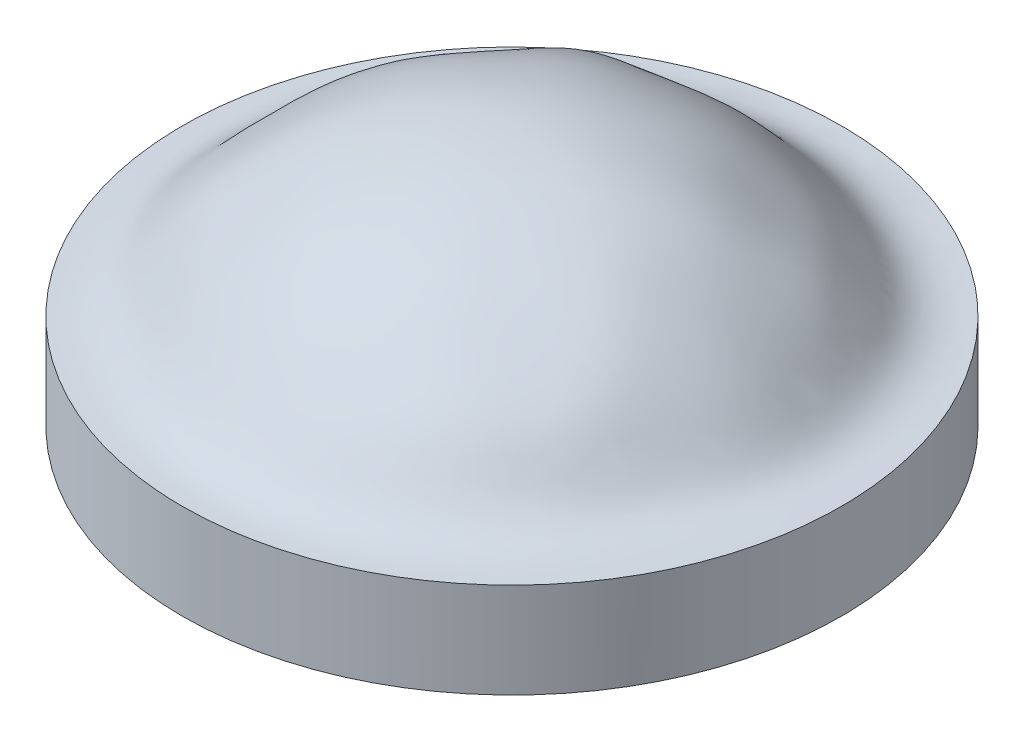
ISO-10303-21;
HEADER;
FILE_DESCRIPTION(('STEP AP214'),'2;1');
FILE_NAME('part.step','',(''),(''),'','','');
FILE_SCHEMA(('AUTOMOTIVE_DESIGN { 1 0 10303 214 1 1 1 1 }'));
ENDSEC;
DATA;
#1=APPLICATION_CONTEXT('core data for automotive mechanical design processes');
#2=APPLICATION_PROTOCOL_DEFINITION('international standard','automotive_design',2000,#1);
#3=PRODUCT_CONTEXT('',#1,'mechanical');
#4=PRODUCT('Part','Part','',(#3));
#5=PRODUCT_RELATED_PRODUCT_CATEGORY('part','',(#4));
#6=PRODUCT_DEFINITION_FORMATION('','',#4);
#7=PRODUCT_DEFINITION_CONTEXT('part definition',#1,'design');
#8=PRODUCT_DEFINITION('design','',#6,#7);
#9=PRODUCT_DEFINITION_SHAPE('','',#8);
#10=(LENGTH_UNIT() NAMED_UNIT(*) SI_UNIT(.MILLI.,.METRE.));
#11=(NAMED_UNIT(*) PLANE_ANGLE_UNIT() SI_UNIT($,.RADIAN.));
#12=(NAMED_UNIT(*) SI_UNIT($,.STERADIAN.) SOLID_ANGLE_UNIT());
#13=UNCERTAINTY_MEASURE_WITH_UNIT(LENGTH_MEASURE(1.E-05),#10,'distance_accuracy_value','');
#14=(GEOMETRIC_REPRESENTATION_CONTEXT(3) GLOBAL_UNCERTAINTY_ASSIGNED_CONTEXT((#13)) GLOBAL_UNIT_ASSIGNED_CONTEXT((#10,
#11,#12)) REPRESENTATION_CONTEXT('',''));
#15=CARTESIAN_POINT('',(0.,0.,0.));
#16=DIRECTION('',(0.,0.,1.));
#17=DIRECTION('',(1.,0.,0.));
#18=AXIS2_PLACEMENT_3D('',#15,#16,#17);
#19=CARTESIAN_POINT('',(-35.5226864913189,12.2853963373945,-34.6000857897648));
#20=CARTESIAN_POINT('',(-34.2932035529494,12.5983433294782,-34.659800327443));
#21=CARTESIAN_POINT('',(-31.9349826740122,12.9464040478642,-35.0365431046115));
#22=CARTESIAN_POINT('',(-27.8924752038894,12.6746638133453,-34.7169109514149));
#23=CARTESIAN_POINT('',(-23.319355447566,10.8754227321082,-34.9154026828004));
#24=CARTESIAN_POINT('',(-17.5047239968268,10.1119375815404,-34.9769828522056));
#25=CARTESIAN_POINT('',(-11.6731992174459,9.977244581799,-35.0138360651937));
#26=CARTESIAN_POINT('',(-5.83863273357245,9.99716292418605,-35.0327033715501));
#27=CARTESIAN_POINT('',(0.000238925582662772,9.99831315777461,-35.0328217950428));
#28=CARTESIAN_POINT('',(5.83938248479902,9.99732332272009,-35.0326949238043));
#29=CARTESIAN_POINT('',(11.6811567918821,9.96419965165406,-35.0146621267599));
#30=CARTESIAN_POINT('',(17.4947019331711,9.89352429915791,-34.9889074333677));
#31=CARTESIAN_POINT('',(23.1754415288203,9.65126325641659,-34.9766955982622));
#32=CARTESIAN_POINT('',(27.3967452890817,8.90491840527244,-34.8903182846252));
#33=CARTESIAN_POINT('',(31.1950617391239,11.3772508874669,-35.5372329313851));
#34=CARTESIAN_POINT('',(33.5313468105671,11.3824886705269,-35.2377620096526));
#35=CARTESIAN_POINT('',(34.7724966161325,11.7132210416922,-35.2255062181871));
#36=CARTESIAN_POINT('',(-35.5342685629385,11.7619439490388,-33.3856293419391));
#37=CARTESIAN_POINT('',(-34.3279663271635,11.9966616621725,-33.5559225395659));
#38=CARTESIAN_POINT('',(-31.8204907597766,12.7356878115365,-33.6664962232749));
#39=CARTESIAN_POINT('',(-27.9812804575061,11.8635729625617,-33.7865666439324));
#40=CARTESIAN_POINT('',(-23.3285003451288,10.4549887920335,-33.8519919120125));
#41=CARTESIAN_POINT('',(-17.5136244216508,10.0362061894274,-33.891368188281));
#42=CARTESIAN_POINT('',(-11.6832312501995,10.0097950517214,-33.8919057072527));
#43=CARTESIAN_POINT('',(-5.84307774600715,10.0267107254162,-33.881555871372));
#44=CARTESIAN_POINT('',(-0.000605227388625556,10.0042513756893,-33.8690313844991));
#45=CARTESIAN_POINT('',(5.8351408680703,10.0290535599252,-33.8813889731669));
#46=CARTESIAN_POINT('',(11.6754146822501,10.0396603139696,-33.8896912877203));
#47=CARTESIAN_POINT('',(17.5009995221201,9.99392765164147,-33.8900787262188));
#48=CARTESIAN_POINT('',(23.2428148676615,9.80705408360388,-33.88264965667));
#49=CARTESIAN_POINT('',(27.6286459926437,9.5341812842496,-33.9295528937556));
#50=CARTESIAN_POINT('',(31.1156175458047,10.7484520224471,-34.1071483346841));
#51=CARTESIAN_POINT('',(33.6947980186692,11.4989093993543,-34.0745419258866));
#52=CARTESIAN_POINT('',(34.8364221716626,11.799057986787,-33.9972341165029));
#53=CARTESIAN_POINT('',(-35.8137679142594,11.6555911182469,-31.0983236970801));
#54=CARTESIAN_POINT('',(-34.3784335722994,10.8838491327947,-31.0310824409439));
#55=CARTESIAN_POINT('',(-31.7057372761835,10.7673795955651,-31.3125719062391));
#56=CARTESIAN_POINT('',(-28.0184362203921,10.4590833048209,-31.5353528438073));
#57=CARTESIAN_POINT('',(-23.3658940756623,10.1059608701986,-31.6255067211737));
#58=CARTESIAN_POINT('',(-17.5384744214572,10.0061683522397,-31.5734219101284));
#59=CARTESIAN_POINT('',(-11.6774348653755,9.95536773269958,-31.4870284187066));
#60=CARTESIAN_POINT('',(-5.81826908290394,9.89454648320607,-31.4524522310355));
#61=CARTESIAN_POINT('',(0.0210012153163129,9.85503598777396,-31.4536355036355));
#62=CARTESIAN_POINT('',(5.85803380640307,9.86311248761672,-31.4550675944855));
#63=CARTESIAN_POINT('',(11.7021527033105,9.98421644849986,-31.4900813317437));
#64=CARTESIAN_POINT('',(17.5452881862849,10.1191390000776,-31.5672654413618));
#65=CARTESIAN_POINT('',(23.3501728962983,10.0342760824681,-31.6161820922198));
#66=CARTESIAN_POINT('',(27.9005554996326,9.82608809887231,-31.5901984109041));
#67=CARTESIAN_POINT('',(31.3747718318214,10.4261613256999,-31.5661428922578));
#68=CARTESIAN_POINT('',(33.8244558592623,11.6890221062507,-31.5482932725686));
#69=CARTESIAN_POINT('',(35.2032759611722,12.0858424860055,-31.6498026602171));
#70=CARTESIAN_POINT('',(-35.0606099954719,8.11899997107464,-27.401921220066));
#71=CARTESIAN_POINT('',(-34.0444611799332,9.09434156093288,-27.6303760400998));
#72=CARTESIAN_POINT('',(-31.6288758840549,9.76572401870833,-27.9008698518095));
#73=CARTESIAN_POINT('',(-28.1021713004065,10.1356231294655,-28.1070807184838));
#74=CARTESIAN_POINT('',(-23.410937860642,10.0873110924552,-28.0780922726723));
#75=CARTESIAN_POINT('',(-17.4851840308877,9.75200352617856,-27.8779341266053));
#76=CARTESIAN_POINT('',(-11.614192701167,9.73358853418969,-27.8845472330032));
#77=CARTESIAN_POINT('',(-5.88666918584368,10.3802195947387,-28.263690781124));
#78=CARTESIAN_POINT('',(-0.232297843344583,11.342310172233,-28.7255505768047));
#79=CARTESIAN_POINT('',(5.68743986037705,10.2134979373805,-28.2543082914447));
#80=CARTESIAN_POINT('',(11.6072046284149,9.61959718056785,-27.8879462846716));
#81=CARTESIAN_POINT('',(17.5226116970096,9.87304944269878,-27.8882265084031));
#82=CARTESIAN_POINT('',(23.4301966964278,10.2320425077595,-28.0677988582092));
#83=CARTESIAN_POINT('',(28.097744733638,10.0949258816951,-28.093905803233));
#84=CARTESIAN_POINT('',(31.5634284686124,10.1738358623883,-27.9793474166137));
#85=CARTESIAN_POINT('',(33.8860883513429,10.8897388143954,-27.8700690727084));
#86=CARTESIAN_POINT('',(34.8609380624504,11.0896793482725,-27.73725548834));
#87=CARTESIAN_POINT('',(-35.0138783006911,9.30420339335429,-23.1731945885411));
#88=CARTESIAN_POINT('',(-33.9080592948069,9.66287983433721,-23.2467982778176));
#89=CARTESIAN_POINT('',(-31.6297519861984,10.0894472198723,-23.3614629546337));
#90=CARTESIAN_POINT('',(-28.0651132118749,10.2662143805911,-23.4306897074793));
#91=CARTESIAN_POINT('',(-23.2018472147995,9.61379405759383,-23.2170902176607));
#92=CARTESIAN_POINT('',(-17.3785862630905,9.6137418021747,-23.254190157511));
#93=CARTESIAN_POINT('',(-11.930590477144,12.0410253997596,-24.3168441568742));
#94=CARTESIAN_POINT('',(-6.36626542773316,15.5156268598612,-26.1071595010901));
#95=CARTESIAN_POINT('',(0.280387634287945,14.6811575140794,-26.1060123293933));
#96=CARTESIAN_POINT('',(6.08347490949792,14.7482921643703,-26.1000453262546));
#97=CARTESIAN_POINT('',(11.6763825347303,11.2284796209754,-24.294250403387));
#98=CARTESIAN_POINT('',(17.3286523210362,9.37002822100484,-23.2511724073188));
#99=CARTESIAN_POINT('',(23.2296104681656,9.70171755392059,-23.2273204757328));
#100=CARTESIAN_POINT('',(28.0707247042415,10.1434719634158,-23.4138233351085));
#101=CARTESIAN_POINT('',(31.6197464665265,10.0547657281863,-23.3505917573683));
#102=CARTESIAN_POINT('',(33.8784204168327,10.1982026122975,-23.3043163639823));
#103=CARTESIAN_POINT('',(34.9705750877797,10.4099038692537,-23.2897602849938));
#104=CARTESIAN_POINT('',(-34.9788145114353,9.75020462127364,-17.4895894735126));
#105=CARTESIAN_POINT('',(-33.8991356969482,10.0194096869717,-17.5050494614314));
#106=CARTESIAN_POINT('',(-31.5709024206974,10.1807643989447,-17.5472791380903));
#107=CARTESIAN_POINT('',(-27.8570125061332,9.7609452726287,-17.5056707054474));
#108=CARTESIAN_POINT('',(-23.282894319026,9.43505533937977,-17.3415389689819));
#109=CARTESIAN_POINT('',(-18.6935057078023,13.5239150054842,-18.5866278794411));
#110=CARTESIAN_POINT('',(-13.569355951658,22.4750943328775,-21.4362901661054));
#111=CARTESIAN_POINT('',(-6.78799689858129,16.3716720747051,-19.8611886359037));
#112=CARTESIAN_POINT('',(-0.256994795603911,21.6815821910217,-21.6827200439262));
#113=CARTESIAN_POINT('',(7.17443085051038,18.1588600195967,-19.8770077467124));
#114=CARTESIAN_POINT('',(13.4590287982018,18.9213910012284,-21.485042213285));
#115=CARTESIAN_POINT('',(18.5610510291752,13.248010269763,-18.613015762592));
#116=CARTESIAN_POINT('',(23.2509617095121,9.46512781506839,-17.3445760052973));
#117=CARTESIAN_POINT('',(27.887210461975,9.85024562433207,-17.5190374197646));
#118=CARTESIAN_POINT('',(31.5663430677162,10.0371338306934,-17.5342209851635));
#119=CARTESIAN_POINT('',(33.8898078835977,10.0064957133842,-17.5035435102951));
#120=CARTESIAN_POINT('',(34.9917716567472,10.0601066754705,-17.5156909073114));
#121=CARTESIAN_POINT('',(-35.0061507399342,9.92089502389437,-11.6788663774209));
#122=CARTESIAN_POINT('',(-33.8993521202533,10.0947208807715,-11.6784245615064));
#123=CARTESIAN_POINT('',(-31.4688526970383,9.90189369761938,-11.6947671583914));
#124=CARTESIAN_POINT('',(-27.8835962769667,9.5482081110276,-11.6044054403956));
#125=CARTESIAN_POINT('',(-24.4877559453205,11.8469779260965,-11.7640386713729));
#126=CARTESIAN_POINT('',(-21.3537558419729,17.4834910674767,-13.5477556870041));
#127=CARTESIAN_POINT('',(-13.4618217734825,17.5554839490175,-13.3381726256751));
#128=CARTESIAN_POINT('',(-7.56652416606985,26.751137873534,-15.6791817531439));
#129=CARTESIAN_POINT('',(0.168292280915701,21.627342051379,-14.5098333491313));
#130=CARTESIAN_POINT('',(7.65877279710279,25.9664337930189,-15.7043847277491));
#131=CARTESIAN_POINT('',(13.2257357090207,16.4856550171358,-13.2498974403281));
#132=CARTESIAN_POINT('',(21.6085029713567,21.5866198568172,-13.7167360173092));
#133=CARTESIAN_POINT('',(24.2812780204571,11.4361137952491,-11.724180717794));
#134=CARTESIAN_POINT('',(27.8901718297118,9.69933738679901,-11.617895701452));
#135=CARTESIAN_POINT('',(31.4930626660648,10.0025381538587,-11.7009069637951));
#136=CARTESIAN_POINT('',(33.8874124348,10.0022747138,-11.6725845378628));
#137=CARTESIAN_POINT('',(35.0168170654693,9.98777915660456,-11.6822319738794));
#138=CARTESIAN_POINT('',(-35.0320889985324,9.9948920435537,-5.83924342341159));
#139=CARTESIAN_POINT('',(-33.8885658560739,10.0606760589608,-5.83690698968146));
#140=CARTESIAN_POINT('',(-31.4188139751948,9.6997492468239,-5.84864234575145));
#141=CARTESIAN_POINT('',(-28.4130072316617,10.796754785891,-5.73161164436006));
#142=CARTESIAN_POINT('',(-26.39513030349,16.0299460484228,-6.22249058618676));
#143=CARTESIAN_POINT('',(-19.8098025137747,19.1845169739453,-7.18080570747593));
#144=CARTESIAN_POINT('',(-15.5725798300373,25.7550422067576,-7.65055211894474));
#145=CARTESIAN_POINT('',(-7.29244627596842,23.670399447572,-7.48704507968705));
#146=CARTESIAN_POINT('',(0.052073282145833,28.9729347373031,-8.02893337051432));
#147=CARTESIAN_POINT('',(7.47014783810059,23.3344898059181,-7.48123145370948));
#148=CARTESIAN_POINT('',(15.7534413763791,26.4699460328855,-7.68314616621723));
#149=CARTESIAN_POINT('',(19.8315687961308,16.9854860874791,-6.92245759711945));
#150=CARTESIAN_POINT('',(26.0690647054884,14.8396408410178,-6.10396920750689));
#151=CARTESIAN_POINT('',(28.2213998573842,10.0432230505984,-5.70399669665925));
#152=CARTESIAN_POINT('',(31.4644387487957,9.94826907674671,-5.85962943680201));
#153=CARTESIAN_POINT('',(33.8795211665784,10.0150705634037,-5.8351792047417));
#154=CARTESIAN_POINT('',(35.0328596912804,9.99828034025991,-5.83934181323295));
#155=CARTESIAN_POINT('',(-35.0322970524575,9.99572760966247,-0.000102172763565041));
#156=CARTESIAN_POINT('',(-33.8702731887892,10.0102825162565,0.000287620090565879));
#157=CARTESIAN_POINT('',(-31.4170184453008,9.69915385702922,-0.0122313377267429));
#158=CARTESIAN_POINT('',(-29.0927556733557,12.7794260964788,0.147806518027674));
#159=CARTESIAN_POINT('',(-25.7598717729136,13.574576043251,-0.25813287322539));
#160=CARTESIAN_POINT('',(-21.858848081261,22.5527150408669,0.209813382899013));
#161=CARTESIAN_POINT('',(-14.328163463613,21.8698072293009,-0.192613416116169));
#162=CARTESIAN_POINT('',(-7.96341465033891,29.2017893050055,-0.00552030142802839));
#163=CARTESIAN_POINT('',(0.167953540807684,25.5921960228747,-0.199117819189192));
#164=CARTESIAN_POINT('',(8.09172182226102,29.0028420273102,0.0342265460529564));
#165=CARTESIAN_POINT('',(14.5681530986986,21.8038875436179,-0.120119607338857));
#166=CARTESIAN_POINT('',(21.5522940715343,20.5770047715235,0.209098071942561));
#167=CARTESIAN_POINT('',(26.2361511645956,15.4843600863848,-0.173454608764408));
#168=CARTESIAN_POINT('',(28.62150659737,10.6818182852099,0.206635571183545));
#169=CARTESIAN_POINT('',(31.4634889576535,9.91974893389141,-0.0195729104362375));
#170=CARTESIAN_POINT('',(33.8686764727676,10.0017930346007,0.000627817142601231));
#171=CARTESIAN_POINT('',(35.0329594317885,9.99928094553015,-0.000245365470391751));
#172=CARTESIAN_POINT('',(-35.0321032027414,9.99473112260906,5.83877071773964));
#173=CARTESIAN_POINT('',(-33.888807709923,10.0583590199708,5.84133341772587));
#174=CARTESIAN_POINT('',(-31.4151838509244,9.73021665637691,5.82701409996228));
#175=CARTESIAN_POINT('',(-28.4180031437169,10.9789221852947,5.85905275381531));
#176=CARTESIAN_POINT('',(-26.4424107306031,17.8411186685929,6.29656813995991));
#177=CARTESIAN_POINT('',(-19.8526380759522,16.7884185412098,6.73987992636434));
#178=CARTESIAN_POINT('',(-15.5172977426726,27.1932738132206,7.62472798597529));
#179=CARTESIAN_POINT('',(-7.28879917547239,23.5023876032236,7.29133076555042));
#180=CARTESIAN_POINT('',(0.106055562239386,29.5523559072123,8.03334939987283));
#181=CARTESIAN_POINT('',(7.44513460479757,23.0991036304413,7.18931607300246));
#182=CARTESIAN_POINT('',(15.7030060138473,26.0007668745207,7.66274881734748));
#183=CARTESIAN_POINT('',(20.1115614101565,18.4172572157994,6.76315199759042));
#184=CARTESIAN_POINT('',(25.9564450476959,14.0307287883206,6.45828201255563));
#185=CARTESIAN_POINT('',(28.1989554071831,9.9250038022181,5.87715678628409));
#186=CARTESIAN_POINT('',(31.4638509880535,9.94839943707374,5.82136959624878));
#187=CARTESIAN_POINT('',(33.8795937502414,10.0152407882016,5.84270588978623));
#188=CARTESIAN_POINT('',(35.0328672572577,9.99830302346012,5.838651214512));
#189=CARTESIAN_POINT('',(-35.0049139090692,9.93380383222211,11.6754407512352));
#190=CARTESIAN_POINT('',(-33.9025238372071,10.0658758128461,11.6806429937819));
#191=CARTESIAN_POINT('',(-31.4663106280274,9.86596862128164,11.6805213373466));
#192=CARTESIAN_POINT('',(-27.8738357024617,9.6034847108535,11.6183623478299));
#193=CARTESIAN_POINT('',(-24.4858506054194,12.9060380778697,11.927625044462));
#194=CARTESIAN_POINT('',(-21.0911589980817,21.476006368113,13.7768068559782));
#195=CARTESIAN_POINT('',(-13.4516741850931,17.8316291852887,13.4636150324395));
#196=CARTESIAN_POINT('',(-7.54135107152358,26.337662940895,15.5574540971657));
#197=CARTESIAN_POINT('',(-0.0760947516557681,21.2068911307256,14.2874775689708));
#198=CARTESIAN_POINT('',(7.95751683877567,27.8689450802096,15.6393033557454));
#199=CARTESIAN_POINT('',(13.2156982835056,16.597688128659,13.325694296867));
#200=CARTESIAN_POINT('',(21.3198031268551,19.4378079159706,13.6689174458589));
#201=CARTESIAN_POINT('',(24.1859284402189,10.8036382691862,11.9456449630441));
#202=CARTESIAN_POINT('',(27.8828266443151,9.6780486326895,11.6120059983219));
#203=CARTESIAN_POINT('',(31.4987291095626,10.0352232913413,11.6783499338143));
#204=CARTESIAN_POINT('',(33.8880872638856,10.0027275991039,11.6818629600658));
#205=CARTESIAN_POINT('',(35.0163679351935,9.98661006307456,11.6738830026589));
#206=CARTESIAN_POINT('',(-34.9603334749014,9.967351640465,17.5103892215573));
#207=CARTESIAN_POINT('',(-33.8995460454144,10.0700954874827,17.5133438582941));
#208=CARTESIAN_POINT('',(-31.5810501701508,10.0823410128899,17.5358488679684));
#209=CARTESIAN_POINT('',(-27.8530341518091,9.62261992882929,17.4826999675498));
#210=CARTESIAN_POINT('',(-23.2755275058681,9.60060795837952,17.3801350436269));
#211=CARTESIAN_POINT('',(-18.6505299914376,13.7802002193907,18.694514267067));
#212=CARTESIAN_POINT('',(-13.6837846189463,19.0094164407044,21.1522148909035));
#213=CARTESIAN_POINT('',(-6.9294582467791,18.2781159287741,19.9497663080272));
#214=CARTESIAN_POINT('',(0.0954396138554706,23.2724582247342,21.9208965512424));
#215=CARTESIAN_POINT('',(6.62282437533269,15.9171300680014,19.7223374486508));
#216=CARTESIAN_POINT('',(14.1438142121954,22.2352415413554,21.2316463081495));
#217=CARTESIAN_POINT('',(18.6604876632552,13.6110433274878,18.6666417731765));
#218=CARTESIAN_POINT('',(23.22480731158,9.34762148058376,17.3802270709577));
#219=CARTESIAN_POINT('',(27.9055774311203,9.96798778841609,17.4841077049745));
#220=CARTESIAN_POINT('',(31.5723192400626,10.0633103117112,17.5370224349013));
#221=CARTESIAN_POINT('',(33.8839418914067,9.97220891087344,17.5139383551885));
#222=CARTESIAN_POINT('',(34.9833736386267,10.0348056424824,17.5110594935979));
#223=CARTESIAN_POINT('',(-34.9097907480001,10.4490637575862,23.330609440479));
#224=CARTESIAN_POINT('',(-33.855202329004,10.2775555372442,23.3347548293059));
#225=CARTESIAN_POINT('',(-31.635011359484,10.1710470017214,23.3700584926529));
#226=CARTESIAN_POINT('',(-28.0789509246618,10.1524071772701,23.4109803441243));
#227=CARTESIAN_POINT('',(-23.201166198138,9.57480021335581,23.1967326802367));
#228=CARTESIAN_POINT('',(-17.378791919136,9.47202679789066,23.2706369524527));
#229=CARTESIAN_POINT('',(-11.9237223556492,11.8803691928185,24.4759030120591));
#230=CARTESIAN_POINT('',(-6.42402200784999,15.7043982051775,26.3746938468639));
#231=CARTESIAN_POINT('',(-0.0307107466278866,13.4098643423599,25.676641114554));
#232=CARTESIAN_POINT('',(6.27488607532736,17.6872469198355,26.5782261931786));
#233=CARTESIAN_POINT('',(11.8606784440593,12.8502104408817,24.5418852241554));
#234=CARTESIAN_POINT('',(17.352903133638,9.55242663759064,23.2831530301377));
#235=CARTESIAN_POINT('',(23.2209483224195,9.65690753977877,23.2049795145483));
#236=CARTESIAN_POINT('',(28.0798166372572,10.1909411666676,23.409187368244));
#237=CARTESIAN_POINT('',(31.6047172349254,9.95551957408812,23.3667337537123));
#238=CARTESIAN_POINT('',(33.8441195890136,10.032584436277,23.3382327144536));
#239=CARTESIAN_POINT('',(34.9232307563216,10.2576643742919,23.3461193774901));
#240=CARTESIAN_POINT('',(-34.7664752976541,11.634066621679,27.9088615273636));
#241=CARTESIAN_POINT('',(-33.8171404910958,11.1713130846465,27.9857038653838));
#242=CARTESIAN_POINT('',(-31.5594514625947,10.3238350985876,28.0107004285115));
#243=CARTESIAN_POINT('',(-28.1084142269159,10.1340509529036,28.1094892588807));
#244=CARTESIAN_POINT('',(-23.4141273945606,10.2132735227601,28.0794890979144));
#245=CARTESIAN_POINT('',(-17.483348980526,9.7764055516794,27.8544993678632));
#246=CARTESIAN_POINT('',(-11.614175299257,9.60771035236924,27.8722052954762));
#247=CARTESIAN_POINT('',(-5.84332090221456,10.7449422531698,28.4228901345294));
#248=CARTESIAN_POINT('',(-0.0892538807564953,12.6574055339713,29.1374556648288));
#249=CARTESIAN_POINT('',(5.75394333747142,10.867879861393,28.4347306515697));
#250=CARTESIAN_POINT('',(11.6123531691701,9.58282492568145,27.8742522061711));
#251=CARTESIAN_POINT('',(17.4964287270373,9.6363902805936,27.8506586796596));
#252=CARTESIAN_POINT('',(23.4106539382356,10.1441043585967,28.0687141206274));
#253=CARTESIAN_POINT('',(28.0986398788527,10.0980544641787,28.1014659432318));
#254=CARTESIAN_POINT('',(31.5471673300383,10.073222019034,28.0237034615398));
#255=CARTESIAN_POINT('',(33.7971105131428,10.4844701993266,28.0010238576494));
#256=CARTESIAN_POINT('',(34.723317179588,10.7025926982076,27.9527687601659));
#257=CARTESIAN_POINT('',(-35.2660941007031,12.2910692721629,31.7624119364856));
#258=CARTESIAN_POINT('',(-33.8964372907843,12.14293755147,31.6628683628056));
#259=CARTESIAN_POINT('',(-31.519343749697,11.1053034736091,31.5707186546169));
#260=CARTESIAN_POINT('',(-27.9911502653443,10.0583413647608,31.5659316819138));
#261=CARTESIAN_POINT('',(-23.3704124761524,10.0627497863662,31.6328823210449));
#262=CARTESIAN_POINT('',(-17.5379674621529,10.1200999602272,31.5824199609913));
#263=CARTESIAN_POINT('',(-11.6803370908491,9.92033792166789,31.4673377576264));
#264=CARTESIAN_POINT('',(-5.82992538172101,9.74066986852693,31.410915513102));
#265=CARTESIAN_POINT('',(0.00897649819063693,9.71920802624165,31.4119202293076));
#266=CARTESIAN_POINT('',(5.84976645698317,9.74882597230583,31.4143577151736));
#267=CARTESIAN_POINT('',(11.6939489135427,9.88476437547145,31.4652985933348));
#268=CARTESIAN_POINT('',(17.5339560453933,10.0856196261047,31.5743197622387));
#269=CARTESIAN_POINT('',(23.3663023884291,10.178139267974,31.6336661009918));
#270=CARTESIAN_POINT('',(28.0008610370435,10.3105351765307,31.6141562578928));
#271=CARTESIAN_POINT('',(31.5203347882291,11.033503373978,31.6542090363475));
#272=CARTESIAN_POINT('',(33.9224456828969,11.5147588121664,31.5333618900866));
#273=CARTESIAN_POINT('',(35.3218227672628,11.5637440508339,31.5378966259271));
#274=CARTESIAN_POINT('',(-35.0106878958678,12.4603912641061,34.0401351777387));
#275=CARTESIAN_POINT('',(-33.8912257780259,12.0992920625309,34.08399097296));
#276=CARTESIAN_POINT('',(-31.4839984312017,11.8635252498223,34.0575562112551));
#277=CARTESIAN_POINT('',(-27.9244773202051,10.3178308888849,33.8297550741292));
#278=CARTESIAN_POINT('',(-23.3231736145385,9.97292560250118,33.8513127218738));
#279=CARTESIAN_POINT('',(-17.513748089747,10.0186559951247,33.897666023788));
#280=CARTESIAN_POINT('',(-11.6808424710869,10.0674890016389,33.903701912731));
#281=CARTESIAN_POINT('',(-5.84080233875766,10.0550340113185,33.8897954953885));
#282=CARTESIAN_POINT('',(-0.00032319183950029,10.0090554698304,33.8704492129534));
#283=CARTESIAN_POINT('',(5.83714576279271,10.0542449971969,33.8895407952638));
#284=CARTESIAN_POINT('',(11.6747073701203,10.0603294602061,33.9005678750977));
#285=CARTESIAN_POINT('',(17.5084228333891,10.06372900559,33.9013418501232));
#286=CARTESIAN_POINT('',(23.3251127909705,10.229311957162,33.9003015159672));
#287=CARTESIAN_POINT('',(27.9316822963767,10.9384899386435,33.9844322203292));
#288=CARTESIAN_POINT('',(31.501653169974,11.5459683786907,33.9483168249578));
#289=CARTESIAN_POINT('',(33.9592078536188,11.7228002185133,33.9358179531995));
#290=CARTESIAN_POINT('',(35.0737793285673,11.9139547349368,33.8899799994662));
#291=CARTESIAN_POINT('',(-35.0068264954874,12.4728776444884,35.2237393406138));
#292=CARTESIAN_POINT('',(-33.827636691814,12.2935912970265,35.2115109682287));
#293=CARTESIAN_POINT('',(-31.5357915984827,12.1920351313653,35.502859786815));
#294=CARTESIAN_POINT('',(-27.8410374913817,10.2476659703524,34.7342119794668));
#295=CARTESIAN_POINT('',(-23.3127482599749,9.99040438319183,34.9005122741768));
#296=CARTESIAN_POINT('',(-17.5069365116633,9.89258604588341,34.955700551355));
#297=CARTESIAN_POINT('',(-11.6755138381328,9.9354283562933,35.0036878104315));
#298=CARTESIAN_POINT('',(-5.83886917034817,9.99495620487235,35.032004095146));
#299=CARTESIAN_POINT('',(0.000150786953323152,9.99637415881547,35.0322353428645));
#300=CARTESIAN_POINT('',(5.83912556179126,9.99489010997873,35.0319855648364));
#301=CARTESIAN_POINT('',(11.680303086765,9.93963734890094,35.0050621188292));
#302=CARTESIAN_POINT('',(17.5160374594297,9.96118072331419,34.9776408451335));
#303=CARTESIAN_POINT('',(23.3073247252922,10.290387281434,35.0047684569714));
#304=CARTESIAN_POINT('',(27.7941858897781,11.0333477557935,35.0829224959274));
#305=CARTESIAN_POINT('',(31.6191486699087,11.8473811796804,35.201035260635));
#306=CARTESIAN_POINT('',(33.8869944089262,11.9360926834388,35.086444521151));
#307=CARTESIAN_POINT('',(35.0837872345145,12.0419140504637,35.0791350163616));
#308=B_SPLINE_SURFACE_WITH_KNOTS('',5,5,((#19,#20,#21,#22,#23,#24,#25,#26,#27,#28,#29,#30,#31,
#32,#33,#34,#35),(#36,#37,#38,#39,#40,#41,#42,#43,#44,#45,#46,#47,#48,#49,#50,#51,#52),(#53,#54,
#55,#56,#57,#58,#59,#60,#61,#62,#63,#64,#65,#66,#67,#68,#69),(#70,#71,#72,#73,#74,#75,#76,#77,
#78,#79,#80,#81,#82,#83,#84,#85,#86),(#87,#88,#89,#90,#91,#92,#93,#94,#95,#96,#97,#98,#99,#100,
#101,#102,#103),(#104,#105,#106,#107,#108,#109,#110,#111,#112,#113,#114,#115,#116,#117,#118,
#119,#120),(#121,#122,#123,#124,#125,#126,#127,#128,#129,#130,#131,#132,#133,#134,#135,#136,
#137),(#138,#139,#140,#141,#142,#143,#144,#145,#146,#147,#148,#149,#150,#151,#152,#153,#154),
(#155,#156,#157,#158,#159,#160,#161,#162,#163,#164,#165,#166,#167,#168,#169,#170,#171),(#172,
#173,#174,#175,#176,#177,#178,#179,#180,#181,#182,#183,#184,#185,#186,#187,#188),(#189,#190,
#191,#192,#193,#194,#195,#196,#197,#198,#199,#200,#201,#202,#203,#204,#205),(#206,#207,#208,
#209,#210,#211,#212,#213,#214,#215,#216,#217,#218,#219,#220,#221,#222),(#223,#224,#225,#226,
#227,#228,#229,#230,#231,#232,#233,#234,#235,#236,#237,#238,#239),(#240,#241,#242,#243,#244,
#245,#246,#247,#248,#249,#250,#251,#252,#253,#254,#255,#256),(#257,#258,#259,#260,#261,#262,
#263,#264,#265,#266,#267,#268,#269,#270,#271,#272,#273),(#274,#275,#276,#277,#278,#279,#280,
#281,#282,#283,#284,#285,#286,#287,#288,#289,#290),(#291,#292,#293,#294,#295,#296,#297,#298,
#299,#300,#301,#302,#303,#304,#305,#306,#307)),.UNSPECIFIED.,.F.,.F.,.F.,(6,1,1,1,1,1,1,1,1,1,1,
1,6),(6,1,1,1,1,1,1,1,1,1,1,1,6),(0.,0.3,0.600000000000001,0.900000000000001,1.2,1.5,1.8,2.1,
2.4,2.7,3.,3.3,3.6),(0.,0.3,0.600000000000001,0.900000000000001,1.2,1.5,1.8,2.1,2.4,2.7,3.,3.3,
3.6),.UNSPECIFIED.);
#309=CARTESIAN_POINT('',(-2.42514180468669E-06,9.99999793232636,34.6185576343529));
#310=CARTESIAN_POINT('',(0.972617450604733,9.99999807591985,34.6185646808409));
#311=CARTESIAN_POINT('',(1.94512280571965,9.99999896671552,34.5775518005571));
#312=CARTESIAN_POINT('',(3.88354571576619,10.0000014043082,34.4137864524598));
#313=CARTESIAN_POINT('',(4.84946147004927,10.0000029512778,34.2910124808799));
#314=CARTESIAN_POINT('',(6.7685718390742,10.0000011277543,33.9643860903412));
#315=CARTESIAN_POINT('',(7.72175117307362,9.99999775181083,33.7604439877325));
#316=CARTESIAN_POINT('',(9.60746739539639,9.99999790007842,33.2729530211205));
#317=CARTESIAN_POINT('',(10.5400056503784,10.0000014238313,32.9894094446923));
#318=CARTESIAN_POINT('',(12.3774459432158,10.0000016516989,32.3448736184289));
#319=CARTESIAN_POINT('',(13.2823603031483,9.9999983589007,31.9839164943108));
#320=CARTESIAN_POINT('',(15.0585746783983,9.99999819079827,31.1870383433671));
#321=CARTESIAN_POINT('',(15.9298741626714,10.0000013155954,30.7511161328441));
#322=CARTESIAN_POINT('',(17.6324298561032,10.0000023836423,29.8075321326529));
#323=CARTESIAN_POINT('',(18.4636962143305,10.0000003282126,29.2998886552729));
#324=CARTESIAN_POINT('',(20.0805118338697,9.99999903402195,28.2163886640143));
#325=CARTESIAN_POINT('',(20.8660612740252,9.99999979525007,27.6405324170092));
#326=CARTESIAN_POINT('',(22.385943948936,9.99999965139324,26.4246335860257));
#327=CARTESIAN_POINT('',(23.1202717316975,9.99999874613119,25.7845841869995));
#328=CARTESIAN_POINT('',(24.5323996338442,10.0000002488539,24.4448996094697));
#329=CARTESIAN_POINT('',(25.2101996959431,10.0000026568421,23.7452643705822));
#330=CARTESIAN_POINT('',(26.5044779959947,10.0000013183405,22.2913541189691));
#331=CARTESIAN_POINT('',(27.1209538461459,9.99999757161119,21.5370769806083));
#332=CARTESIAN_POINT('',(28.2881706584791,9.99999766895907,19.9792698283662));
#333=CARTESIAN_POINT('',(28.8389116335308,10.0000015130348,19.1757398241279));
#334=CARTESIAN_POINT('',(29.8707336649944,10.000002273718,17.5251549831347));
#335=CARTESIAN_POINT('',(30.3518160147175,9.99999919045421,16.6781009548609));
#336=CARTESIAN_POINT('',(31.240912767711,9.9999983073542,14.946476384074));
#337=CARTESIAN_POINT('',(31.6489271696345,10.0000005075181,14.0619058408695));
#338=CARTESIAN_POINT('',(32.3889865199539,10.0000014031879,12.2615388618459));
#339=CARTESIAN_POINT('',(32.721031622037,10.0000000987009,11.3457424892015));
#340=CARTESIAN_POINT('',(33.3067927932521,9.99999938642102,9.48943290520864));
#341=CARTESIAN_POINT('',(33.5605088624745,9.99999997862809,8.54891969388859));
#342=CARTESIAN_POINT('',(33.9878086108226,10.0000000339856,6.64986108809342));
#343=CARTESIAN_POINT('',(34.1613921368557,9.99999949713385,5.6913156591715));
#344=CARTESIAN_POINT('',(34.4271920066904,9.99999975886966,3.7630090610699));
#345=CARTESIAN_POINT('',(34.5194083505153,10.0000005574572,2.79324789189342));
#346=CARTESIAN_POINT('',(34.6218181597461,10.0000008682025,0.849406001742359));
#347=CARTESIAN_POINT('',(34.6320117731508,10.0000003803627,-0.12467471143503));
#348=CARTESIAN_POINT('',(34.5703040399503,9.99999966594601,-2.07023231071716));
#349=CARTESIAN_POINT('',(34.4984026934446,9.99999943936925,-3.04170919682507));
#350=CARTESIAN_POINT('',(34.2730161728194,9.99999967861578,-4.97515289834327));
#351=CARTESIAN_POINT('',(34.119530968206,10.0000001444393,-5.93711971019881));
#352=CARTESIAN_POINT('',(33.7320678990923,10.0000000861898,-7.84470389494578));
#353=CARTESIAN_POINT('',(33.4980900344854,9.99999956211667,-8.79032126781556));
#354=CARTESIAN_POINT('',(32.9513047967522,10.0000000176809,-10.6584847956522));
#355=CARTESIAN_POINT('',(32.6384973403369,10.0000009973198,-11.5810309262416));
#356=CARTESIAN_POINT('',(31.9362769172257,10.0000006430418,-13.3964921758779));
#357=CARTESIAN_POINT('',(31.5468639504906,9.99999930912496,-14.2894072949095));
#358=CARTESIAN_POINT('',(30.6942011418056,9.99999863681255,-16.0392581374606));
#359=CARTESIAN_POINT('',(30.2309513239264,9.99999929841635,-16.8961938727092));
#360=CARTESIAN_POINT('',(29.2339081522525,10.0000003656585,-18.567993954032));
#361=CARTESIAN_POINT('',(28.7001147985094,10.0000007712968,-19.382858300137));
#362=CARTESIAN_POINT('',(27.5657797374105,10.0000006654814,-20.9647220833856));
#363=CARTESIAN_POINT('',(26.9652380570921,10.0000001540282,-21.7317215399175));
#364=CARTESIAN_POINT('',(25.7016756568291,9.9999991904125,-23.2124029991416));
#365=CARTESIAN_POINT('',(25.0386549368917,9.99999873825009,-23.92608500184));
#366=CARTESIAN_POINT('',(23.6548480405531,9.99999954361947,-25.2950577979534));
#367=CARTESIAN_POINT('',(22.9340618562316,10.0000008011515,-25.9503485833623));
#368=CARTESIAN_POINT('',(21.4398484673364,10.0000018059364,-27.1978801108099));
#369=CARTESIAN_POINT('',(20.6664212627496,10.0000015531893,-27.7901208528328));
#370=CARTESIAN_POINT('',(19.0724243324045,9.99999889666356,-28.9073418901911));
#371=CARTESIAN_POINT('',(18.2518546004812,9.9999964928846,-29.4323221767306));
#372=CARTESIAN_POINT('',(16.5694064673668,9.9999982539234,-30.4112899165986));
#373=CARTESIAN_POINT('',(15.7075280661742,10.0000024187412,-30.8652773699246));
#374=CARTESIAN_POINT('',(13.9485900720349,10.0000023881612,-31.6990318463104));
#375=CARTESIAN_POINT('',(13.0515304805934,9.99999819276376,-32.0787988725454));
#376=CARTESIAN_POINT('',(11.2286076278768,9.99999727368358,-32.761412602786));
#377=CARTESIAN_POINT('',(10.3027443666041,10.0000005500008,-33.0642593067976));
#378=CARTESIAN_POINT('',(8.42879654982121,10.000002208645,-33.590879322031));
#379=CARTESIAN_POINT('',(7.48071199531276,10.0000005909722,-33.8146526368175));
#380=CARTESIAN_POINT('',(5.56906186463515,9.99999926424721,-34.1815349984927));
#381=CARTESIAN_POINT('',(4.60549628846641,9.999999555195,-34.3246440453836));
#382=CARTESIAN_POINT('',(2.66973448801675,9.99999945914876,-34.5291804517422));
#383=CARTESIAN_POINT('',(1.6975382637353,9.99999907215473,-34.5906078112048));
#384=CARTESIAN_POINT('',(-0.248573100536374,9.99999965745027,-34.6313441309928));
#385=CARTESIAN_POINT('',(-1.22248824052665,10.0000006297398,-34.610653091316));
#386=CARTESIAN_POINT('',(-3.16511352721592,10.0000014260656,-34.4872997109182));
#387=CARTESIAN_POINT('',(-4.13382367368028,10.0000012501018,-34.3846373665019));
#388=CARTESIAN_POINT('',(-6.05915198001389,9.99999942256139,-34.0980712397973));
#389=CARTESIAN_POINT('',(-7.01577013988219,9.99999777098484,-33.9141674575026));
#390=CARTESIAN_POINT('',(-8.91011353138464,9.99999943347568,-33.4664258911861));
#391=CARTESIAN_POINT('',(-9.84783876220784,10.0000027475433,-33.2025881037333));
#392=CARTESIAN_POINT('',(-11.6977295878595,10.0000008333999,-32.5968542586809));
#393=CARTESIAN_POINT('',(-12.6098951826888,9.99999560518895,-32.2549582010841));
#394=CARTESIAN_POINT('',(-14.4021816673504,9.99999892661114,-31.4955385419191));
#395=CARTESIAN_POINT('',(-15.2823025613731,10.0000074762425,-31.0780149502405));
#396=CARTESIAN_POINT('',(-17.0042426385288,10.0000032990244,-30.1703085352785));
#397=CARTESIAN_POINT('',(-17.8460618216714,9.99999057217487,-29.6801257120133));
#398=CARTESIAN_POINT('',(-19.4854135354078,9.99999281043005,-28.6305858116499));
#399=CARTESIAN_POINT('',(-20.2829460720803,10.0000077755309,-28.0712287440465));
#400=CARTESIAN_POINT('',(-21.8280546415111,10.0000082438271,-26.8873169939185));
#401=CARTESIAN_POINT('',(-22.5756306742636,9.99999374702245,-26.2627623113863));
#402=CARTESIAN_POINT('',(-24.0155117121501,9.99999326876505,-24.9528952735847));
#403=CARTESIAN_POINT('',(-24.7078166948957,10.0000072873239,-24.2675828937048));
#404=CARTESIAN_POINT('',(-26.0322334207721,10.0000055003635,-22.8410728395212));
#405=CARTESIAN_POINT('',(-26.6643451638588,9.99998969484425,-22.0998751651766));
#406=CARTESIAN_POINT('',(-27.8638816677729,9.99999245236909,-20.5668637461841));
#407=CARTESIAN_POINT('',(-28.4313064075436,10.0000110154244,-19.7750499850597));
#408=CARTESIAN_POINT('',(-29.4974346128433,10.0000111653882,-18.1464359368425));
#409=CARTESIAN_POINT('',(-29.9961380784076,9.99999275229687,-17.3096356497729));
#410=CARTESIAN_POINT('',(-30.9212777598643,9.99998915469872,-15.5969986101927));
#411=CARTESIAN_POINT('',(-31.3477140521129,10.0000039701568,-14.7211618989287));
#412=CARTESIAN_POINT('',(-32.1252883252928,10.0000087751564,-12.9366778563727));
#413=CARTESIAN_POINT('',(-32.4764263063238,9.99999876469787,-12.0280305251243));
#414=CARTESIAN_POINT('',(-33.1009074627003,9.99999406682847,-10.184385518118));
#415=CARTESIAN_POINT('',(-33.3742506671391,9.99999937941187,-9.24938785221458));
#416=CARTESIAN_POINT('',(-33.8411991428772,10.0000025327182,-7.35968911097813));
#417=CARTESIAN_POINT('',(-34.0348044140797,10.0000003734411,-6.40498803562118));
#418=CARTESIAN_POINT('',(-34.3409008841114,9.9999999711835,-4.48266808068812));
#419=CARTESIAN_POINT('',(-34.4533919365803,10.0000017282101,-3.51504917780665));
#420=CARTESIAN_POINT('',(-34.5964596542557,10.0000007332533,-1.57377445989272));
#421=CARTESIAN_POINT('',(-34.6270363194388,9.99999798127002,-0.600118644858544));
#422=CARTESIAN_POINT('',(-34.6060579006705,9.99999767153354,1.34630591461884));
#423=CARTESIAN_POINT('',(-34.5545029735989,10.0000001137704,2.3190746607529));
#424=CARTESIAN_POINT('',(-34.3696281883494,10.0000012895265,4.25681115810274));
#425=CARTESIAN_POINT('',(-34.2363083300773,10.0000000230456,5.22177890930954));
#426=CARTESIAN_POINT('',(-33.8888511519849,9.99999982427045,7.13705502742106));
#427=CARTESIAN_POINT('',(-33.6747136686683,10.0000008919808,8.08736336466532));
#428=CARTESIAN_POINT('',(-33.1671436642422,10.0000004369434,9.96656249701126));
#429=CARTESIAN_POINT('',(-32.8737111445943,9.99999891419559,10.8954532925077));
#430=CARTESIAN_POINT('',(-32.2096310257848,9.99999856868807,12.7252304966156));
#431=CARTESIAN_POINT('',(-31.8389819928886,9.99999974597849,13.6261163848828));
#432=CARTESIAN_POINT('',(-31.0231072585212,10.0000007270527,15.3934608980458));
#433=CARTESIAN_POINT('',(-30.5778815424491,10.0000005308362,16.2599195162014));
#434=CARTESIAN_POINT('',(-29.6160376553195,10.0000001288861,17.9522160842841));
#435=CARTESIAN_POINT('',(-29.0994222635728,9.99999992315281,18.7780556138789));
#436=CARTESIAN_POINT('',(-27.9984590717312,10.0000003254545,20.3832783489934));
#437=CARTESIAN_POINT('',(-27.4141113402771,10.0000009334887,21.1626616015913));
#438=CARTESIAN_POINT('',(-26.1819027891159,9.99999933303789,22.6693518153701));
#439=CARTESIAN_POINT('',(-25.5340487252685,9.99999712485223,23.3966643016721));
#440=CARTESIAN_POINT('',(-24.179377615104,9.99999953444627,24.7941374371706));
#441=CARTESIAN_POINT('',(-23.4725603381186,10.0000041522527,25.4642978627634));
#442=CARTESIAN_POINT('',(-22.0048013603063,10.0000026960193,26.7428635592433));
#443=CARTESIAN_POINT('',(-21.2438459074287,9.99999661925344,27.3512530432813));
#444=CARTESIAN_POINT('',(-19.6733946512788,9.9999960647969,28.5017464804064));
#445=CARTESIAN_POINT('',(-18.8638996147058,10.000001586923,29.0438514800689));
#446=CARTESIAN_POINT('',(-17.2017363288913,10.0000034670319,30.0581623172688));
#447=CARTESIAN_POINT('',(-16.3490486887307,9.99999982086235,30.5303363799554));
#448=CARTESIAN_POINT('',(-14.6068546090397,9.99999775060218,31.4011594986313));
#449=CARTESIAN_POINT('',(-13.7173457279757,9.99999932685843,31.7998036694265));
#450=CARTESIAN_POINT('',(-11.9088757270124,10.0000010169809,32.5202935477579));
#451=CARTESIAN_POINT('',(-10.9899482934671,10.0000011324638,32.8422237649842));
#452=CARTESIAN_POINT('',(-9.12855577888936,10.0000005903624,33.4074850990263));
#453=CARTESIAN_POINT('',(-8.18609695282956,9.99999993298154,33.6508368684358));
#454=CARTESIAN_POINT('',(-6.04711314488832,9.99999928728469,34.1079426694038));
#455=CARTESIAN_POINT('',(-4.84572783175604,9.99999950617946,34.2992607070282));
#456=CARTESIAN_POINT('',(-2.42950295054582,9.99999873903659,34.5545637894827));
#457=CARTESIAN_POINT('',(-1.21466338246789,9.99999775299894,34.6185488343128));
#458=CARTESIAN_POINT('',(-2.42514180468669E-06,9.99999793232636,34.6185576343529));
#459=B_SPLINE_CURVE_WITH_KNOTS('',3,(#309,#310,#311,#312,#313,#314,#315,#316,#317,#318,#319,
#320,#321,#322,#323,#324,#325,#326,#327,#328,#329,#330,#331,#332,#333,#334,#335,#336,#337,#338,
#339,#340,#341,#342,#343,#344,#345,#346,#347,#348,#349,#350,#351,#352,#353,#354,#355,#356,#357,
#358,#359,#360,#361,#362,#363,#364,#365,#366,#367,#368,#369,#370,#371,#372,#373,#374,#375,#376,
#377,#378,#379,#380,#381,#382,#383,#384,#385,#386,#387,#388,#389,#390,#391,#392,#393,#394,#395,
#396,#397,#398,#399,#400,#401,#402,#403,#404,#405,#406,#407,#408,#409,#410,#411,#412,#413,#414,
#415,#416,#417,#418,#419,#420,#421,#422,#423,#424,#425,#426,#427,#428,#429,#430,#431,#432,#433,
#434,#435,#436,#437,#438,#439,#440,#441,#442,#443,#444,#445,#446,#447,#448,#449,#450,#451,#452,
#453,#454,#455,#456,#457,#458),.UNSPECIFIED.,.T.,.F.,(4,2,2,2,2,2,2,2,2,2,2,2,2,2,2,2,2,2,2,2,2,
2,2,2,2,2,2,2,2,2,2,2,2,2,2,2,2,2,2,2,2,2,2,2,2,2,2,2,2,2,2,2,2,2,2,2,2,2,2,2,2,2,2,2,2,2,2,2,2,
2,2,2,2,2,4),(0.,2.9167986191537,5.83436468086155,8.75516338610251,11.6757681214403,
14.5950504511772,17.5143788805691,20.4329632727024,23.3515362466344,26.2704193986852,
29.1893055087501,32.1083052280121,35.027304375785,37.9462493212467,40.8651943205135,
43.7841334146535,46.7030725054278,49.6220171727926,52.5409618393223,55.4599012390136,
58.3788406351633,61.2977811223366,64.2167216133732,67.1356651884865,70.0546087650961,
72.9735513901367,75.8924940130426,78.8114354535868,81.7303768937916,84.6493187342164,
87.5682605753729,90.4872027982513,93.4061450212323,96.3250871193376,99.2440292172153,
102.162971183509,105.081913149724,108.00085511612,110.919797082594,113.838739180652,
116.757681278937,119.676623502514,122.595565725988,125.514507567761,128.433449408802,
131.352390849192,134.271332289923,137.190274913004,140.109217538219,143.028161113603,
145.94710468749,148.866045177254,151.784985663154,154.703925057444,157.622864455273,
160.541809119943,163.460753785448,166.379692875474,169.298631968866,172.217576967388,
175.136521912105,178.055521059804,180.974520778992,183.893406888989,186.812290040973,
189.730863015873,192.649447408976,195.568775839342,198.488058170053,201.408662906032,
204.329461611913,207.24702767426,210.163826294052,213.806484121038,217.449141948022),.UNSPECIFIED.);
#460=CARTESIAN_POINT('',(-2.42514180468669E-06,9.99999793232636,34.6185576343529));
#461=VERTEX_POINT('',#460);
#462=EDGE_CURVE('E34',#461,#461,#459,.T.);
#463=ORIENTED_EDGE('',*,*,#462,.T.);
#464=EDGE_LOOP('',(#463));
#465=FACE_BOUND('',#464,.T.);
#466=ADVANCED_FACE('F29',(#465),#308,.T.);
#467=CARTESIAN_POINT('',(0.,0.,0.));
#468=DIRECTION('',(0.,1.,0.));
#469=DIRECTION('',(0.,0.,1.));
#470=AXIS2_PLACEMENT_3D('',#467,#468,#469);
#471=PLANE('',#470);
#472=CARTESIAN_POINT('',(0.,0.,0.));
#473=DIRECTION('',(0.,1.,0.));
#474=DIRECTION('',(0.,0.,1.));
#475=AXIS2_PLACEMENT_3D('',#472,#473,#474);
#476=CIRCLE('',#475,34.618557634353);
#477=CARTESIAN_POINT('',(0.,0.,34.618557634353));
#478=VERTEX_POINT('',#477);
#479=EDGE_CURVE('E11',#478,#478,#476,.T.);
#480=ORIENTED_EDGE('',*,*,#479,.F.);
#481=EDGE_LOOP('',(#480));
#482=FACE_BOUND('',#481,.T.);
#483=ADVANCED_FACE('F48',(#482),#471,.F.);
#484=CARTESIAN_POINT('',(0.,10.,0.));
#485=DIRECTION('',(0.,-1.,0.));
#486=DIRECTION('',(0.,0.,-1.));
#487=AXIS2_PLACEMENT_3D('',#484,#485,#486);
#488=CYLINDRICAL_SURFACE('',#487,34.618557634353);
#489=ORIENTED_EDGE('',*,*,#462,.F.);
#490=EDGE_LOOP('',(#489));
#491=FACE_BOUND('',#490,.T.);
#492=ORIENTED_EDGE('',*,*,#479,.T.);
#493=EDGE_LOOP('',(#492));
#494=FACE_BOUND('',#493,.T.);
#495=ADVANCED_FACE('F31',(#491,#494),#488,.T.);
#496=CLOSED_SHELL('',(#466,#483,#495));
#497=MANIFOLD_SOLID_BREP('B2',#496);
#498=ADVANCED_BREP_SHAPE_REPRESENTATION('',(#18,#497),#14);
#499=SHAPE_DEFINITION_REPRESENTATION(#9,#498);
ENDSEC;
END-ISO-10303-21;
